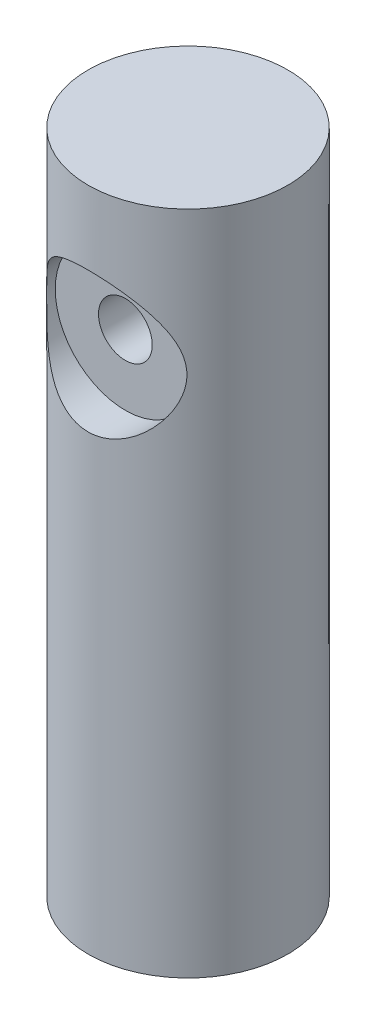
from build123d import *

# Parameters (mm, degrees)
SKETCH3_R      = 15
EXTRUDE2_DEPTH = 100


with BuildPart() as part:
    # Sketch3 → Extrude2 (new body)
    with BuildSketch(Plane(origin=(0, 0, 0), x_dir=(1, 0, 0), z_dir=(0, 1, 0))):
        with Locations(Location((0, 0, 0), (0, 0, 270))):
            Circle(SKETCH3_R)
    extrude(amount=EXTRUDE2_DEPTH)

    # Sketch4 → Cut-Revolve3 (revolve, cut)
    with BuildSketch(Plane(origin=(0, 0, 0), x_dir=(0, 0, -1), z_dir=(1, 0, 0)), mode=Mode.PRIVATE) as cut_revolve3_sk:
        Polygon((-15, 88.971351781), (-9.406878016, 88.971351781), (-9.406878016, 82.476126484), (9.18290473, 82.476126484), (9.18290473, 88.971351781), (15, 88.971351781), (15, 78.444607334), (-15, 78.444607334), align=None)
    revolve(cut_revolve3_sk.sketch.rotate(Axis((0, 78.444607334, -15), (0, 0, 1)), 90), axis=Axis((0, 78.444607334, -15), (0, 0, 1)), mode=Mode.SUBTRACT)


solid = part.part
